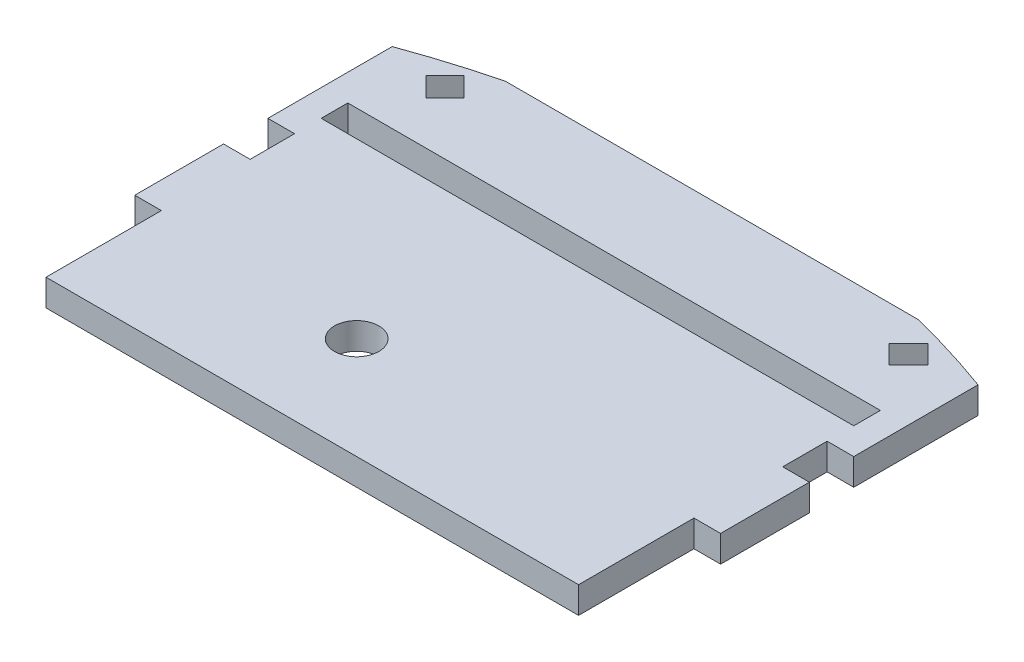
from build123d import *

# Parameters (mm, degrees)
SKETCH1_W           = 60
SKETCH1_H           = 36
BOSS_EXTRUDE1_DEPTH = 3
SKETCH2_R           = 2.5
CUT_EXTRUDE1_DEPTH  = 3
SKETCH3_W           = 3
SKETCH3_H           = 10
BOSS_EXTRUDE2_DEPTH = 3
SKETCH4_W           = 60
SKETCH4_H           = 5
CUT_EXTRUDE2_DEPTH  = 3
SKETCH5_W           = 66
SKETCH5_H           = 17
BOSS_EXTRUDE3_DEPTH = 3
SKETCH6_W           = 60
SKETCH6_H           = 3
CUT_EXTRUDE3_DEPTH  = 3
CUT_EXTRUDE5_DEPTH  = 3


with BuildPart() as part:
    # Sketch1 → Boss-Extrude1 (new body)
    with BuildSketch(Plane(origin=(0, 0, 0), x_dir=(1, 0, 0), z_dir=(0, 1, 0))):
        Rectangle(SKETCH1_W, SKETCH1_H)
    extrude(amount=BOSS_EXTRUDE1_DEPTH)

    # Sketch2 → Cut-Extrude1 (cut)
    with BuildSketch(Plane(origin=(0, 0, 0), x_dir=(1, 0, 0), z_dir=(0, 1, 0))):
        with Locations(Location((-6.5, -6.5, 0), (0, 0, 270))):
            Circle(SKETCH2_R)
    extrude(amount=CUT_EXTRUDE1_DEPTH, mode=Mode.SUBTRACT)

    # Sketch3 → Boss-Extrude2 (add)
    with BuildSketch(Plane(origin=(0, 0, 0), x_dir=(1, 0, 0), z_dir=(0, 1, 0))):
        with Locations((-31.5, 0)):
            Rectangle(SKETCH3_W, SKETCH3_H)
        with Locations((31.5, 0)):
            Rectangle(SKETCH3_W, SKETCH3_H)
    extrude(amount=BOSS_EXTRUDE2_DEPTH)

    # Sketch4 → Cut-Extrude2 (cut)
    with BuildSketch(Plane(origin=(0, 0, 0), x_dir=(1, 0, 0), z_dir=(0, 1, 0))):
        with Locations((0, 15.5)):
            Rectangle(SKETCH4_W, SKETCH4_H)
    extrude(amount=CUT_EXTRUDE2_DEPTH, mode=Mode.SUBTRACT)

    # Sketch5 → Boss-Extrude3 (add)
    with BuildSketch(Plane(origin=(0, 0, 0), x_dir=(1, 0, 0), z_dir=(0, 1, 0))):
        with Locations((0, 18.5)):
            Rectangle(SKETCH5_W, SKETCH5_H)
    extrude(amount=BOSS_EXTRUDE3_DEPTH)

    # Sketch6 → Cut-Extrude3 (cut)
    with BuildSketch(Plane(origin=(0, 0, 0), x_dir=(1, 0, 0), z_dir=(0, 1, 0))):
        with Locations((0, 14.5)):
            Rectangle(SKETCH6_W, SKETCH6_H)
        Polygon((-26.081118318, 20.918881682), (-23.959797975, 23.040202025), (-26.151828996, 25.232233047), (-28.27314934, 23.110912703), align=None)
        Polygon((28.27314934, 23.110912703), (26.151828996, 25.232233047), (23.959797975, 23.040202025), (26.081118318, 20.918881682), align=None)
    extrude(amount=CUT_EXTRUDE3_DEPTH, mode=Mode.SUBTRACT)

    # Sketch8 → Cut-Extrude5 (cut)
    with BuildSketch(Plane(origin=(0, 0, 0), x_dir=(1, 0, 0), z_dir=(0, 1, 0))):
        with BuildLine():
            Line((-33, 24), (-33, 47.18966684))
            Line((-33, 47.18966684), (33, 47.18966684))
            Line((33, 47.18966684), (33, 24))
            ThreePointArc((33, 24), (0, 29.859271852), (-33, 24))
        make_face()
    extrude(amount=CUT_EXTRUDE5_DEPTH, mode=Mode.SUBTRACT)


solid = part.part
